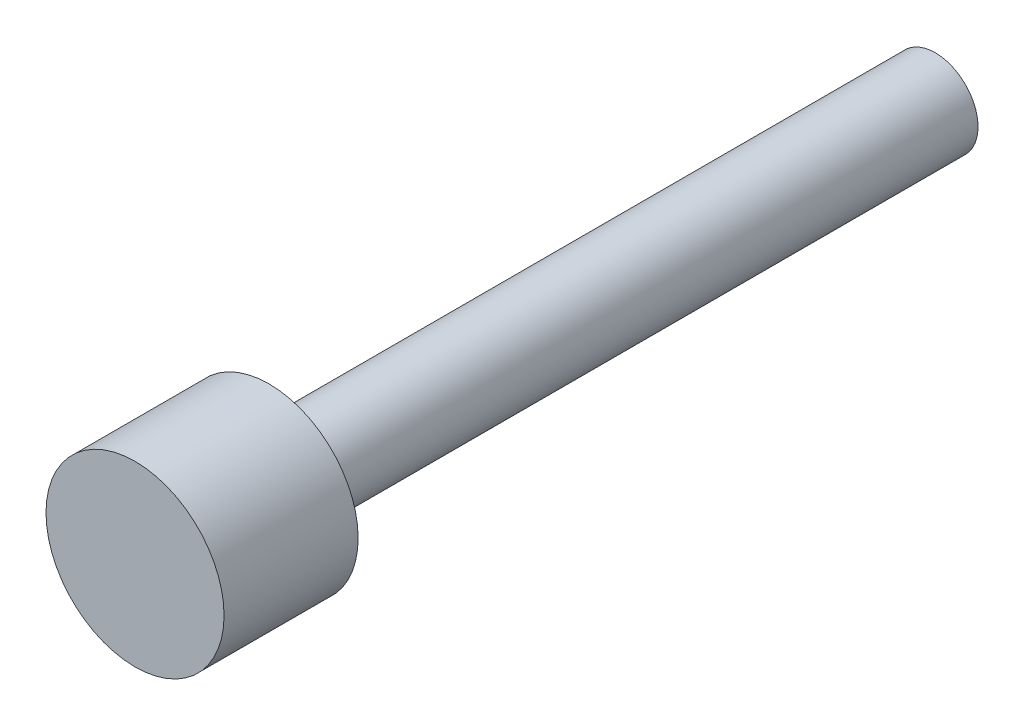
ISO-10303-21;
HEADER;
FILE_DESCRIPTION(('STEP AP214'),'2;1');
FILE_NAME('part.step','',(''),(''),'','','');
FILE_SCHEMA(('AUTOMOTIVE_DESIGN { 1 0 10303 214 1 1 1 1 }'));
ENDSEC;
DATA;
#1=APPLICATION_CONTEXT('core data for automotive mechanical design processes');
#2=APPLICATION_PROTOCOL_DEFINITION('international standard','automotive_design',2000,#1);
#3=PRODUCT_CONTEXT('',#1,'mechanical');
#4=PRODUCT('Part','Part','',(#3));
#5=PRODUCT_RELATED_PRODUCT_CATEGORY('part','',(#4));
#6=PRODUCT_DEFINITION_FORMATION('','',#4);
#7=PRODUCT_DEFINITION_CONTEXT('part definition',#1,'design');
#8=PRODUCT_DEFINITION('design','',#6,#7);
#9=PRODUCT_DEFINITION_SHAPE('','',#8);
#10=(LENGTH_UNIT() NAMED_UNIT(*) SI_UNIT(.MILLI.,.METRE.));
#11=(NAMED_UNIT(*) PLANE_ANGLE_UNIT() SI_UNIT($,.RADIAN.));
#12=(NAMED_UNIT(*) SI_UNIT($,.STERADIAN.) SOLID_ANGLE_UNIT());
#13=UNCERTAINTY_MEASURE_WITH_UNIT(LENGTH_MEASURE(1.E-05),#10,'distance_accuracy_value','');
#14=(GEOMETRIC_REPRESENTATION_CONTEXT(3) GLOBAL_UNCERTAINTY_ASSIGNED_CONTEXT((#13)) GLOBAL_UNIT_ASSIGNED_CONTEXT((#10,
#11,#12)) REPRESENTATION_CONTEXT('',''));
#15=CARTESIAN_POINT('',(0.,0.,0.));
#16=DIRECTION('',(0.,0.,1.));
#17=DIRECTION('',(1.,0.,0.));
#18=AXIS2_PLACEMENT_3D('',#15,#16,#17);
#19=CARTESIAN_POINT('',(108.979522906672,-155.638888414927,-12.7999999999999));
#20=DIRECTION('',(0.,0.,-1.));
#21=DIRECTION('',(0.819152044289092,0.573576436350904,0.));
#22=AXIS2_PLACEMENT_3D('',#19,#20,#21);
#23=PLANE('',#22);
#24=CARTESIAN_POINT('',(0.,0.,-12.7999999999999));
#25=DIRECTION('',(0.,0.,-1.));
#26=DIRECTION('',(-1.,0.,0.));
#27=AXIS2_PLACEMENT_3D('',#24,#25,#26);
#28=CIRCLE('',#27,4.08);
#29=CARTESIAN_POINT('',(-4.08,0.,-12.7999999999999));
#30=VERTEX_POINT('',#29);
#31=EDGE_CURVE('E10',#30,#30,#28,.T.);
#32=ORIENTED_EDGE('',*,*,#31,.F.);
#33=EDGE_LOOP('',(#32));
#34=FACE_BOUND('',#33,.T.);
#35=CARTESIAN_POINT('',(0.,0.,-12.7999999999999));
#36=DIRECTION('',(0.,0.,-1.));
#37=DIRECTION('',(-1.,0.,0.));
#38=AXIS2_PLACEMENT_3D('',#35,#36,#37);
#39=CIRCLE('',#38,8.49999999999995);
#40=CARTESIAN_POINT('',(-8.49999999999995,0.,-12.7999999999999));
#41=VERTEX_POINT('',#40);
#42=EDGE_CURVE('E36',#41,#41,#39,.F.);
#43=ORIENTED_EDGE('',*,*,#42,.F.);
#44=EDGE_LOOP('',(#43));
#45=FACE_BOUND('',#44,.T.);
#46=ADVANCED_FACE('F33',(#34,#45),#23,.T.);
#47=CARTESIAN_POINT('',(0.,0.,0.));
#48=DIRECTION('',(0.,0.,1.));
#49=DIRECTION('',(1.,0.,0.));
#50=AXIS2_PLACEMENT_3D('',#47,#48,#49);
#51=PLANE('',#50);
#52=CARTESIAN_POINT('',(0.,0.,0.));
#53=DIRECTION('',(0.,0.,1.));
#54=DIRECTION('',(1.,0.,0.));
#55=AXIS2_PLACEMENT_3D('',#52,#53,#54);
#56=CIRCLE('',#55,8.49999999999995);
#57=CARTESIAN_POINT('',(8.49999999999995,0.,0.));
#58=VERTEX_POINT('',#57);
#59=EDGE_CURVE('E44',#58,#58,#56,.T.);
#60=ORIENTED_EDGE('',*,*,#59,.T.);
#61=EDGE_LOOP('',(#60));
#62=FACE_BOUND('',#61,.T.);
#63=ADVANCED_FACE('F51',(#62),#51,.T.);
#64=CARTESIAN_POINT('',(0.,0.,-36.8416305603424));
#65=DIRECTION('',(0.,0.,1.));
#66=DIRECTION('',(1.,0.,0.));
#67=AXIS2_PLACEMENT_3D('',#64,#65,#66);
#68=CYLINDRICAL_SURFACE('',#67,8.49999999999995);
#69=ORIENTED_EDGE('',*,*,#59,.F.);
#70=EDGE_LOOP('',(#69));
#71=FACE_BOUND('',#70,.T.);
#72=ORIENTED_EDGE('',*,*,#42,.T.);
#73=EDGE_LOOP('',(#72));
#74=FACE_BOUND('',#73,.T.);
#75=ADVANCED_FACE('F53',(#71,#74),#68,.T.);
#76=CARTESIAN_POINT('',(0.,0.,-87.9399826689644));
#77=DIRECTION('',(0.,0.,1.));
#78=DIRECTION('',(1.,0.,0.));
#79=AXIS2_PLACEMENT_3D('',#76,#77,#78);
#80=CYLINDRICAL_SURFACE('',#79,4.08);
#81=ORIENTED_EDGE('',*,*,#31,.T.);
#82=EDGE_LOOP('',(#81));
#83=FACE_BOUND('',#82,.T.);
#84=CARTESIAN_POINT('',(0.,0.,-76.4));
#85=DIRECTION('',(0.,0.,-1.));
#86=DIRECTION('',(0.,1.,0.));
#87=AXIS2_PLACEMENT_3D('',#84,#85,#86);
#88=CIRCLE('',#87,4.08);
#89=CARTESIAN_POINT('',(0.,4.08,-76.4));
#90=VERTEX_POINT('',#89);
#91=EDGE_CURVE('E46',#90,#90,#88,.T.);
#92=ORIENTED_EDGE('',*,*,#91,.F.);
#93=EDGE_LOOP('',(#92));
#94=FACE_BOUND('',#93,.T.);
#95=ADVANCED_FACE('F56',(#83,#94),#80,.T.);
#96=CARTESIAN_POINT('',(0.,0.,-76.4));
#97=DIRECTION('',(0.,0.,-1.));
#98=DIRECTION('',(-1.,0.,0.));
#99=AXIS2_PLACEMENT_3D('',#96,#97,#98);
#100=PLANE('',#99);
#101=ORIENTED_EDGE('',*,*,#91,.T.);
#102=EDGE_LOOP('',(#101));
#103=FACE_BOUND('',#102,.T.);
#104=ADVANCED_FACE('F68',(#103),#100,.T.);
#105=CLOSED_SHELL('',(#46,#63,#75,#95,#104));
#106=MANIFOLD_SOLID_BREP('B2',#105);
#107=ADVANCED_BREP_SHAPE_REPRESENTATION('',(#18,#106),#14);
#108=SHAPE_DEFINITION_REPRESENTATION(#9,#107);
ENDSEC;
END-ISO-10303-21;
